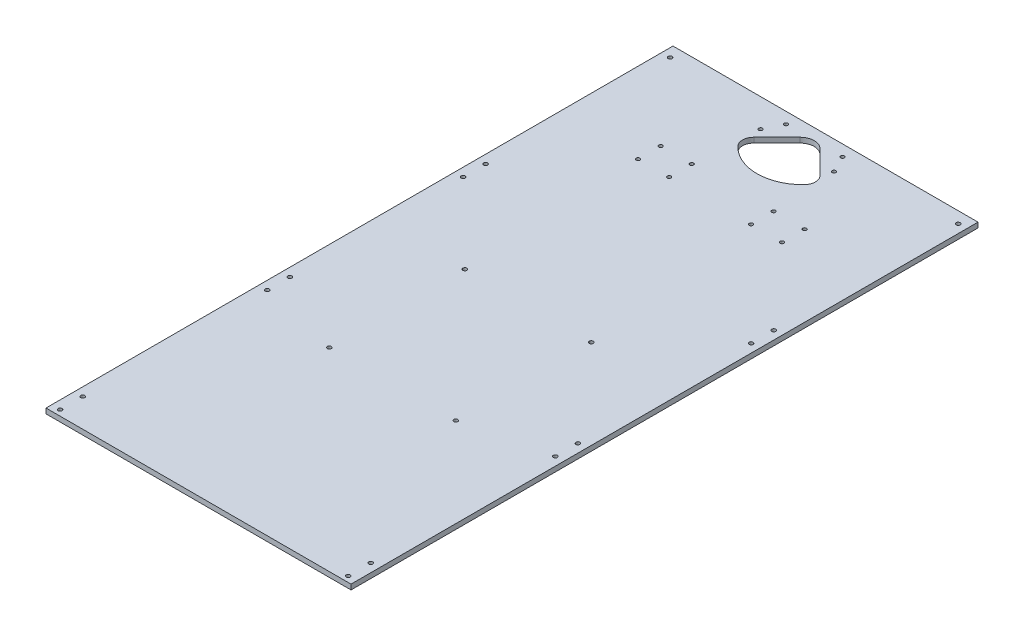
from build123d import *

# Parameters (mm, degrees)
SKETCH1_R            = 3.5
SKETCH1_R_2          = 3.25
BOSS_EXTRUDE1_DEPTH  = 9
FILLET1_R            = 20
FILLET1_OF_MIRROR1_R = 20


with BuildPart() as part:
    # Sketch1 → Boss-Extrude1 (new body)
    with BuildSketch(Plane(origin=(0, 0, 0), x_dir=(1, 0, 0), z_dir=(0, 1, 0))):
        with BuildLine():
            Line((0, 120), (-270, 120))
            Line((-270, 120), (-270, -990))
            Line((-270, -990), (-240, -990))
            Line((-240, -990), (0, -990))
            Line((0, -990), (0, -1.415928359))
            ThreePointArc((0, -1.415928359), (-40.883896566, 9.59360546), (-70.710678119, 39.644660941))
            Line((-70.710678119, 39.644660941), (-17.67766953, 92.67766953))
            ThreePointArc((-17.67766953, 92.67766953), (-9.567085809, 98.096988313), (0, 100))
            Line((0, 100), (0, 120))
        make_face()
        with Locations(Location((-255, -980, 0), (0, 0, 270))):
            Circle(SKETCH1_R, mode=Mode.SUBTRACT)
        with Locations(Location((-255, -940, 0), (0, 0, 270))):
            Circle(SKETCH1_R, mode=Mode.SUBTRACT)
        with Locations(Location((-255, -613.333333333, 0), (0, 0, 270))):
            Circle(SKETCH1_R, mode=Mode.SUBTRACT)
        with Locations(Location((-255, -573.333333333, 0), (0, 0, 270))):
            Circle(SKETCH1_R, mode=Mode.SUBTRACT)
        with Locations(Location((-112, -646.483912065, 0), (0, 0, 270))):
            Circle(SKETCH1_R, mode=Mode.SUBTRACT)
        with Locations(Location((-112, -406.483912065, 0), (0, 0, 270))):
            Circle(SKETCH1_R, mode=Mode.SUBTRACT)
        with Locations(Location((-255, -266.666666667, 0), (0, 0, 270))):
            Circle(SKETCH1_R, mode=Mode.SUBTRACT)
        with Locations(Location((-255, -226.666666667, 0), (0, 0, 270))):
            Circle(SKETCH1_R, mode=Mode.SUBTRACT)
        with Locations(Location((-255, 100, 0), (0, 0, 270))):
            Circle(SKETCH1_R, mode=Mode.SUBTRACT)
        with Locations(Location((-127.5, -84.34, 0), (0, 0, 270))):
            Circle(SKETCH1_R_2, mode=Mode.SUBTRACT)
        with Locations(Location((-127.5, -44.34, 0), (0, 0, 270))):
            Circle(SKETCH1_R_2, mode=Mode.SUBTRACT)
        with Locations(Location((-72.5, -84.34, 0), (0, 0, 270))):
            Circle(SKETCH1_R_2, mode=Mode.SUBTRACT)
        with Locations(Location((-72.5, -44.34, 0), (0, 0, 270))):
            Circle(SKETCH1_R_2, mode=Mode.SUBTRACT)
        with Locations(Location((-65, 70, 0), (0, 0, 270))):
            Circle(SKETCH1_R_2, mode=Mode.SUBTRACT)
        with Locations(Location((-50, 100, 0), (0, 0, 270))):
            Circle(SKETCH1_R_2, mode=Mode.SUBTRACT)
    boss_extrude1 = extrude(amount=BOSS_EXTRUDE1_DEPTH)

    # Fillet1
    fillet1_edges = [part.edges().sort_by_distance(p)[0] for p in [
        (-70.710678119, 4.5, -39.644660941),
    ]]
    fillet(fillet1_edges, radius=FILLET1_R)

    # Mirror1: Boss-Extrude1 across plane
    add(boss_extrude1.mirror(Plane(origin=(0, 0, 0), x_dir=(0, 0, 1), z_dir=(1, 0, 0))))

    # Fillet1 of Mirror1
    fillet1_of_mirror1_edges = [part.edges().sort_by_distance(p)[0] for p in [
        (70.710678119, 4.5, -39.644660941),
    ]]
    fillet(fillet1_of_mirror1_edges, radius=FILLET1_OF_MIRROR1_R)


solid = part.part
